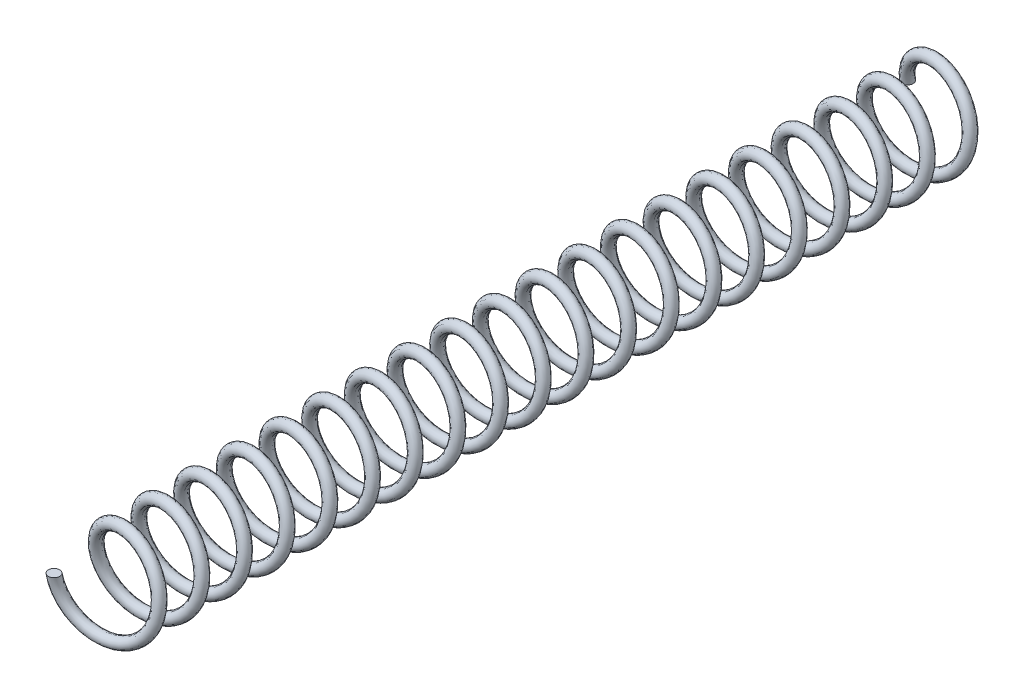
from build123d import *

# Parameters (mm, degrees)
SWEEP2_PITCH       = 11.2625
SWEEP2_HEIGHT      = 225.25
SWEEP2_RADIUS      = 12.5
SWEEP2_START_ANGLE = -180
SKETCH2_R          = 1.5


with BuildPart() as part:
    # Sweep2: sweep along a helix
    with BuildLine() as sweep2_path:
        add(Helix(SWEEP2_PITCH, SWEEP2_HEIGHT, SWEEP2_RADIUS, center=(0, 0, 0), direction=(0, 0, 1), lefthand=True, mode=Mode.PRIVATE).rotate(Axis((0, 0, 0), (0, 0, 1)), SWEEP2_START_ANGLE))
    # Sketch2 → Sweep2 (sweep)
    with BuildSketch(Plane(origin=(0, 0, 0), x_dir=(1, 0, 0), z_dir=(0, 1, 0))):
        with Locations((-11, -225.25)):
            Circle(SKETCH2_R)
    sweep(path=sweep2_path.line, is_frenet=True)


solid = part.part
